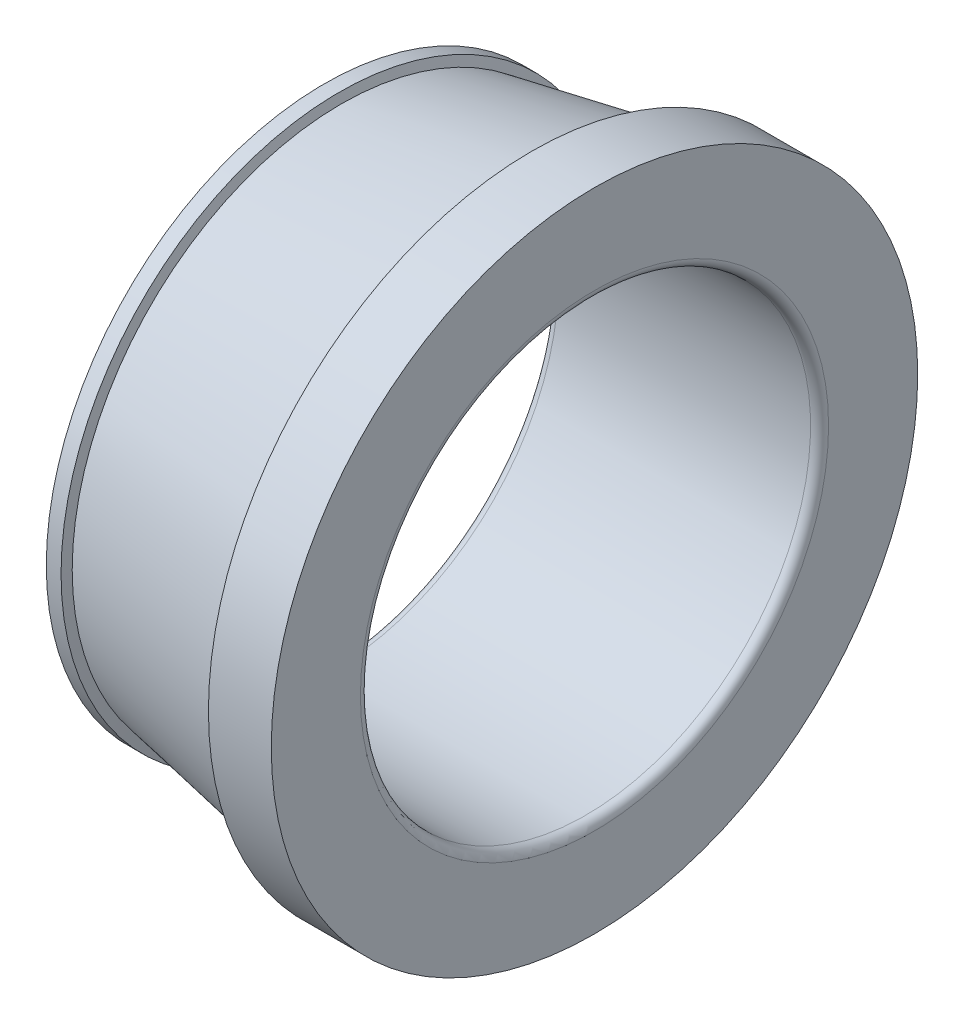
ISO-10303-21;
HEADER;
FILE_DESCRIPTION(('STEP AP214'),'2;1');
FILE_NAME('part.step','',(''),(''),'','','');
FILE_SCHEMA(('AUTOMOTIVE_DESIGN { 1 0 10303 214 1 1 1 1 }'));
ENDSEC;
DATA;
#1=APPLICATION_CONTEXT('core data for automotive mechanical design processes');
#2=APPLICATION_PROTOCOL_DEFINITION('international standard','automotive_design',2000,#1);
#3=PRODUCT_CONTEXT('',#1,'mechanical');
#4=PRODUCT('Part','Part','',(#3));
#5=PRODUCT_RELATED_PRODUCT_CATEGORY('part','',(#4));
#6=PRODUCT_DEFINITION_FORMATION('','',#4);
#7=PRODUCT_DEFINITION_CONTEXT('part definition',#1,'design');
#8=PRODUCT_DEFINITION('design','',#6,#7);
#9=PRODUCT_DEFINITION_SHAPE('','',#8);
#10=(LENGTH_UNIT() NAMED_UNIT(*) SI_UNIT(.MILLI.,.METRE.));
#11=(NAMED_UNIT(*) PLANE_ANGLE_UNIT() SI_UNIT($,.RADIAN.));
#12=(NAMED_UNIT(*) SI_UNIT($,.STERADIAN.) SOLID_ANGLE_UNIT());
#13=UNCERTAINTY_MEASURE_WITH_UNIT(LENGTH_MEASURE(1.E-05),#10,'distance_accuracy_value','');
#14=(GEOMETRIC_REPRESENTATION_CONTEXT(3) GLOBAL_UNCERTAINTY_ASSIGNED_CONTEXT((#13)) GLOBAL_UNIT_ASSIGNED_CONTEXT((#10,
#11,#12)) REPRESENTATION_CONTEXT('',''));
#15=CARTESIAN_POINT('',(0.,0.,0.));
#16=DIRECTION('',(0.,0.,1.));
#17=DIRECTION('',(1.,0.,0.));
#18=AXIS2_PLACEMENT_3D('',#15,#16,#17);
#19=CARTESIAN_POINT('',(1.75,0.,0.));
#20=DIRECTION('',(-1.,0.,0.));
#21=DIRECTION('',(0.,0.,1.));
#22=AXIS2_PLACEMENT_3D('',#19,#20,#21);
#23=TOROIDAL_SURFACE('',#22,13.,0.500000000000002);
#24=CARTESIAN_POINT('',(1.75,0.,0.));
#25=DIRECTION('',(-1.,0.,0.));
#26=DIRECTION('',(0.,0.,1.));
#27=AXIS2_PLACEMENT_3D('',#24,#25,#26);
#28=CIRCLE('',#27,12.5);
#29=CARTESIAN_POINT('',(1.75,0.,12.5));
#30=VERTEX_POINT('',#29);
#31=EDGE_CURVE('E10',#30,#30,#28,.T.);
#32=ORIENTED_EDGE('',*,*,#31,.F.);
#33=EDGE_LOOP('',(#32));
#34=FACE_BOUND('',#33,.T.);
#35=CARTESIAN_POINT('',(1.25,0.,0.));
#36=DIRECTION('',(-1.,0.,0.));
#37=DIRECTION('',(0.,0.,1.));
#38=AXIS2_PLACEMENT_3D('',#35,#36,#37);
#39=CIRCLE('',#38,13.);
#40=CARTESIAN_POINT('',(1.25,0.,13.));
#41=VERTEX_POINT('',#40);
#42=EDGE_CURVE('E63',#41,#41,#39,.T.);
#43=ORIENTED_EDGE('',*,*,#42,.T.);
#44=EDGE_LOOP('',(#43));
#45=FACE_BOUND('',#44,.T.);
#46=ADVANCED_FACE('F29',(#34,#45),#23,.T.);
#47=CARTESIAN_POINT('',(0.,0.,0.));
#48=DIRECTION('',(-1.,0.,0.));
#49=DIRECTION('',(0.,0.,1.));
#50=AXIS2_PLACEMENT_3D('',#47,#48,#49);
#51=CYLINDRICAL_SURFACE('',#50,12.5);
#52=CARTESIAN_POINT('',(15.75,0.,0.));
#53=DIRECTION('',(-1.,0.,0.));
#54=DIRECTION('',(0.,0.,1.));
#55=AXIS2_PLACEMENT_3D('',#52,#53,#54);
#56=CIRCLE('',#55,12.5);
#57=CARTESIAN_POINT('',(15.75,0.,12.5));
#58=VERTEX_POINT('',#57);
#59=EDGE_CURVE('E35',#58,#58,#56,.T.);
#60=ORIENTED_EDGE('',*,*,#59,.F.);
#61=EDGE_LOOP('',(#60));
#62=FACE_BOUND('',#61,.T.);
#63=ORIENTED_EDGE('',*,*,#31,.T.);
#64=EDGE_LOOP('',(#63));
#65=FACE_BOUND('',#64,.T.);
#66=ADVANCED_FACE('F112',(#62,#65),#51,.F.);
#67=CARTESIAN_POINT('',(15.75,0.,0.));
#68=DIRECTION('',(-1.,0.,0.));
#69=DIRECTION('',(0.,0.,1.));
#70=AXIS2_PLACEMENT_3D('',#67,#68,#69);
#71=TOROIDAL_SURFACE('',#70,13.,0.5);
#72=CARTESIAN_POINT('',(16.25,0.,0.));
#73=DIRECTION('',(-1.,0.,0.));
#74=DIRECTION('',(0.,0.,1.));
#75=AXIS2_PLACEMENT_3D('',#72,#73,#74);
#76=CIRCLE('',#75,13.);
#77=CARTESIAN_POINT('',(16.25,0.,13.));
#78=VERTEX_POINT('',#77);
#79=EDGE_CURVE('E39',#78,#78,#76,.T.);
#80=ORIENTED_EDGE('',*,*,#79,.F.);
#81=EDGE_LOOP('',(#80));
#82=FACE_BOUND('',#81,.T.);
#83=ORIENTED_EDGE('',*,*,#59,.T.);
#84=EDGE_LOOP('',(#83));
#85=FACE_BOUND('',#84,.T.);
#86=ADVANCED_FACE('F107',(#82,#85),#71,.T.);
#87=CARTESIAN_POINT('',(16.25,0.,-17.9502223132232));
#88=DIRECTION('',(-1.,0.,0.));
#89=DIRECTION('',(0.,0.,1.));
#90=AXIS2_PLACEMENT_3D('',#87,#88,#89);
#91=PLANE('',#90);
#92=CARTESIAN_POINT('',(16.25,0.,0.));
#93=DIRECTION('',(-1.,0.,0.));
#94=DIRECTION('',(0.,0.,1.));
#95=AXIS2_PLACEMENT_3D('',#92,#93,#94);
#96=CIRCLE('',#95,17.9502223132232);
#97=CARTESIAN_POINT('',(16.25,0.,17.9502223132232));
#98=VERTEX_POINT('',#97);
#99=EDGE_CURVE('E43',#98,#98,#96,.T.);
#100=ORIENTED_EDGE('',*,*,#99,.F.);
#101=EDGE_LOOP('',(#100));
#102=FACE_BOUND('',#101,.T.);
#103=ORIENTED_EDGE('',*,*,#79,.T.);
#104=EDGE_LOOP('',(#103));
#105=FACE_BOUND('',#104,.T.);
#106=ADVANCED_FACE('F101',(#102,#105),#91,.F.);
#107=CARTESIAN_POINT('',(0.,0.,0.));
#108=DIRECTION('',(-1.,0.,0.));
#109=DIRECTION('',(0.,0.,1.));
#110=AXIS2_PLACEMENT_3D('',#107,#108,#109);
#111=CYLINDRICAL_SURFACE('',#110,17.9502223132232);
#112=CARTESIAN_POINT('',(12.7597402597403,0.,0.));
#113=DIRECTION('',(-1.,0.,0.));
#114=DIRECTION('',(0.,0.,1.));
#115=AXIS2_PLACEMENT_3D('',#112,#113,#114);
#116=CIRCLE('',#115,17.9502223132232);
#117=CARTESIAN_POINT('',(12.7597402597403,0.,17.9502223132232));
#118=VERTEX_POINT('',#117);
#119=EDGE_CURVE('E48',#118,#118,#116,.T.);
#120=ORIENTED_EDGE('',*,*,#119,.F.);
#121=EDGE_LOOP('',(#120));
#122=FACE_BOUND('',#121,.T.);
#123=ORIENTED_EDGE('',*,*,#99,.T.);
#124=EDGE_LOOP('',(#123));
#125=FACE_BOUND('',#124,.T.);
#126=ADVANCED_FACE('F95',(#122,#125),#111,.T.);
#127=CARTESIAN_POINT('',(12.7597402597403,0.,0.));
#128=DIRECTION('',(-1.,0.,0.));
#129=DIRECTION('',(0.,0.,1.));
#130=AXIS2_PLACEMENT_3D('',#127,#128,#129);
#131=CONICAL_SURFACE('',#130,17.9502223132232,1.33500576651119);
#132=CARTESIAN_POINT('',(13.,0.,0.));
#133=DIRECTION('',(-1.,0.,0.));
#134=DIRECTION('',(0.,0.,1.));
#135=AXIS2_PLACEMENT_3D('',#132,#133,#134);
#136=CIRCLE('',#135,16.9502223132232);
#137=CARTESIAN_POINT('',(13.,0.,16.9502223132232));
#138=VERTEX_POINT('',#137);
#139=EDGE_CURVE('E51',#138,#138,#136,.T.);
#140=ORIENTED_EDGE('',*,*,#139,.F.);
#141=EDGE_LOOP('',(#140));
#142=FACE_BOUND('',#141,.T.);
#143=ORIENTED_EDGE('',*,*,#119,.T.);
#144=EDGE_LOOP('',(#143));
#145=FACE_BOUND('',#144,.T.);
#146=ADVANCED_FACE('F89',(#142,#145),#131,.F.);
#147=CARTESIAN_POINT('',(13.,0.,0.));
#148=DIRECTION('',(1.,0.,0.));
#149=DIRECTION('',(0.,0.,-1.));
#150=AXIS2_PLACEMENT_3D('',#147,#148,#149);
#151=CONICAL_SURFACE('',#150,16.9502223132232,0.183430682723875);
#152=CARTESIAN_POINT('',(2.18981448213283,0.,0.));
#153=DIRECTION('',(-1.,0.,0.));
#154=DIRECTION('',(0.,0.,1.));
#155=AXIS2_PLACEMENT_3D('',#152,#153,#154);
#156=CIRCLE('',#155,14.9447595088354);
#157=CARTESIAN_POINT('',(2.18981448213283,0.,14.9447595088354));
#158=VERTEX_POINT('',#157);
#159=EDGE_CURVE('E54',#158,#158,#156,.T.);
#160=ORIENTED_EDGE('',*,*,#159,.F.);
#161=EDGE_LOOP('',(#160));
#162=FACE_BOUND('',#161,.T.);
#163=ORIENTED_EDGE('',*,*,#139,.T.);
#164=EDGE_LOOP('',(#163));
#165=FACE_BOUND('',#164,.T.);
#166=ADVANCED_FACE('F83',(#162,#165),#151,.T.);
#167=CARTESIAN_POINT('',(2.18981448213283,0.,0.));
#168=DIRECTION('',(-1.,0.,0.));
#169=DIRECTION('',(0.,0.,1.));
#170=AXIS2_PLACEMENT_3D('',#167,#168,#169);
#171=CONICAL_SURFACE('',#170,14.9447595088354,1.33500576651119);
#172=CARTESIAN_POINT('',(2.06968461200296,0.,0.));
#173=DIRECTION('',(-1.,0.,0.));
#174=DIRECTION('',(0.,0.,1.));
#175=AXIS2_PLACEMENT_3D('',#172,#173,#174);
#176=CIRCLE('',#175,15.4447595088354);
#177=CARTESIAN_POINT('',(2.06968461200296,0.,15.4447595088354));
#178=VERTEX_POINT('',#177);
#179=EDGE_CURVE('E57',#178,#178,#176,.T.);
#180=ORIENTED_EDGE('',*,*,#179,.F.);
#181=EDGE_LOOP('',(#180));
#182=FACE_BOUND('',#181,.T.);
#183=ORIENTED_EDGE('',*,*,#159,.T.);
#184=EDGE_LOOP('',(#183));
#185=FACE_BOUND('',#184,.T.);
#186=ADVANCED_FACE('F77',(#182,#185),#171,.T.);
#187=CARTESIAN_POINT('',(0.,0.,0.));
#188=DIRECTION('',(-1.,0.,0.));
#189=DIRECTION('',(0.,0.,1.));
#190=AXIS2_PLACEMENT_3D('',#187,#188,#189);
#191=CYLINDRICAL_SURFACE('',#190,15.4447595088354);
#192=CARTESIAN_POINT('',(1.25,0.,0.));
#193=DIRECTION('',(-1.,0.,0.));
#194=DIRECTION('',(0.,0.,1.));
#195=AXIS2_PLACEMENT_3D('',#192,#193,#194);
#196=CIRCLE('',#195,15.4447595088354);
#197=CARTESIAN_POINT('',(1.25,0.,15.4447595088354));
#198=VERTEX_POINT('',#197);
#199=EDGE_CURVE('E60',#198,#198,#196,.T.);
#200=ORIENTED_EDGE('',*,*,#199,.F.);
#201=EDGE_LOOP('',(#200));
#202=FACE_BOUND('',#201,.T.);
#203=ORIENTED_EDGE('',*,*,#179,.T.);
#204=EDGE_LOOP('',(#203));
#205=FACE_BOUND('',#204,.T.);
#206=ADVANCED_FACE('F71',(#202,#205),#191,.T.);
#207=CARTESIAN_POINT('',(1.25,0.,-13.));
#208=DIRECTION('',(1.,0.,0.));
#209=DIRECTION('',(0.,0.,-1.));
#210=AXIS2_PLACEMENT_3D('',#207,#208,#209);
#211=PLANE('',#210);
#212=ORIENTED_EDGE('',*,*,#42,.F.);
#213=EDGE_LOOP('',(#212));
#214=FACE_BOUND('',#213,.T.);
#215=ORIENTED_EDGE('',*,*,#199,.T.);
#216=EDGE_LOOP('',(#215));
#217=FACE_BOUND('',#216,.T.);
#218=ADVANCED_FACE('F68',(#214,#217),#211,.F.);
#219=CLOSED_SHELL('',(#46,#66,#86,#106,#126,#146,#166,#186,#206,#218));
#220=MANIFOLD_SOLID_BREP('B2',#219);
#221=ADVANCED_BREP_SHAPE_REPRESENTATION('',(#18,#220),#14);
#222=SHAPE_DEFINITION_REPRESENTATION(#9,#221);
ENDSEC;
END-ISO-10303-21;
